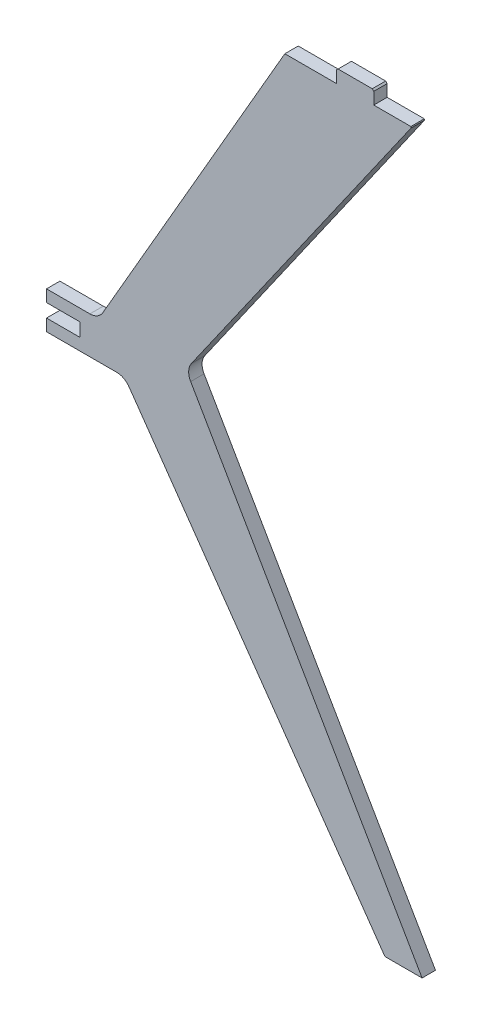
from build123d import *
from OCP.BRepFilletAPI import BRepFilletAPI_MakeChamfer

# Parameters (mm, degrees)
SALIENTE_EXTRUIR1_DEPTH = 18
CROQUIS2_W              = 50
CROQUIS2_H              = 18
SALIENTE_EXTRUIR2_DEPTH = 18
CHAFL_N1_SIZE           = 2
CHAFL_N1_SIZE2          = 1.436030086
REDONDEO1_R             = 20


with BuildPart() as part:
    # Croquis1 → Saliente-Extruir1 (new body)
    with BuildSketch(Plane.XY):
        Polygon((0, 0), (-317.542648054, 550), (-13.652576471, 984), (-184.544129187, 984), (-435.114146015, 550), (-505, 550), (-505, 534), (-460, 534), (-460, 516), (-505, 516), (-505, 500), (-400.103769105, 500), (-50, 0), align=None)
    extrude(amount=SALIENTE_EXTRUIR1_DEPTH)

    # Croquis2 → Saliente-Extruir2 (add)
    with BuildSketch(Plane(origin=(0, 984, 0), x_dir=(1, 0, 0), z_dir=(0, 1, 0))):
        with Locations((-90, -9)):
            Rectangle(CROQUIS2_W, CROQUIS2_H)
    extrude(amount=SALIENTE_EXTRUIR2_DEPTH)

    # Chafl_n1: one chamfer whose edges measure the first distance from different faces: ONE call of the kernel's chamfer builder (chamfer() names one face for all edges)
    chafl_n1_edges_1 = [part.edges().sort_by_distance(p)[0] for p in [
        (-13.652576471, 984, 9),
    ]]
    chafl_n1_side_1 = [part.faces().sort_by_distance(p)[0] for p in [
        (-165.597612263, 767, 9),
    ]]
    chafl_n1_edges_2 = [part.edges().sort_by_distance(p)[0] for p in [
        (-65, 1002, 9),
        (-115, 1002, 9),
    ]]
    chafl_n1 = BRepFilletAPI_MakeChamfer(part.part.solid().wrapped)
    for e in chafl_n1_edges_1:
        chafl_n1.Add(CHAFL_N1_SIZE, CHAFL_N1_SIZE2, e.wrapped, chafl_n1_side_1[0].wrapped)  # the first distance lies on this face
    for e in chafl_n1_edges_2:
        chafl_n1.Add(CHAFL_N1_SIZE, e.wrapped)
    add(Compound.cast(chafl_n1.Shape()), mode=Mode.REPLACE)

    # Redondeo1
    redondeo1_edges = [part.edges().sort_by_distance(p)[0] for p in [
        (-400.103769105, 500, 9),
        (-435.114146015, 550, 9),
        (-317.542648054, 550, 9),
    ]]
    fillet(redondeo1_edges, radius=REDONDEO1_R)


solid = part.part
